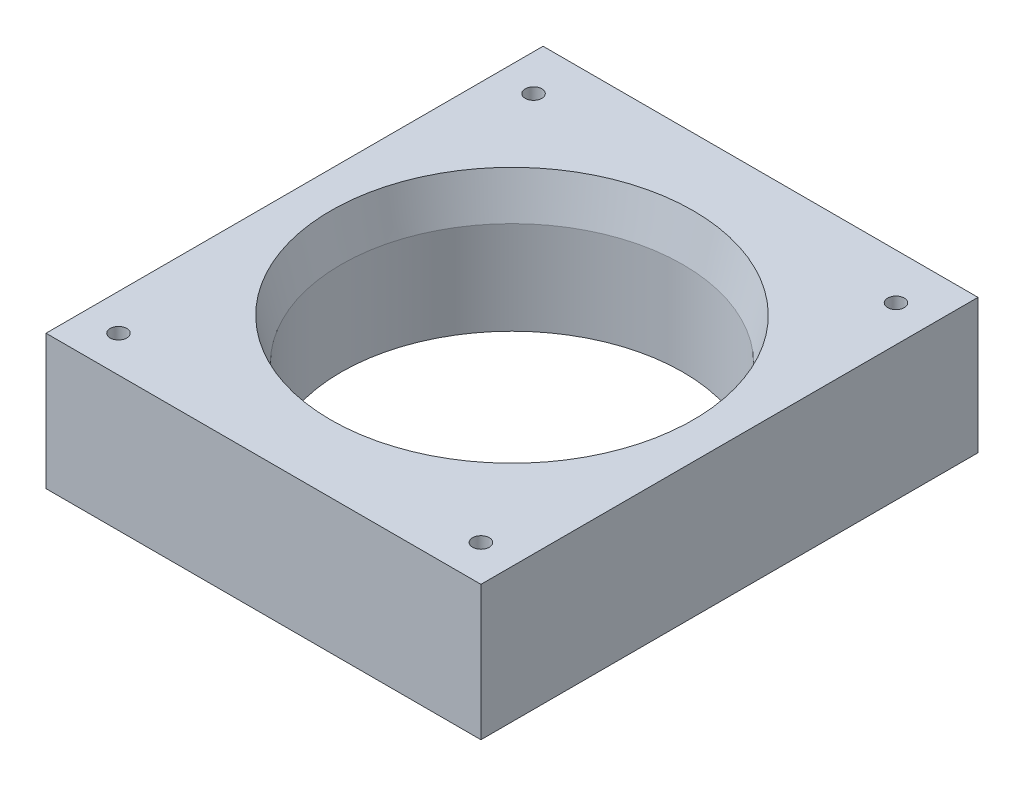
ISO-10303-21;
HEADER;
FILE_DESCRIPTION(('STEP AP214'),'2;1');
FILE_NAME('part.step','',(''),(''),'','','');
FILE_SCHEMA(('AUTOMOTIVE_DESIGN { 1 0 10303 214 1 1 1 1 }'));
ENDSEC;
DATA;
#1=APPLICATION_CONTEXT('core data for automotive mechanical design processes');
#2=APPLICATION_PROTOCOL_DEFINITION('international standard','automotive_design',2000,#1);
#3=PRODUCT_CONTEXT('',#1,'mechanical');
#4=PRODUCT('Part','Part','',(#3));
#5=PRODUCT_RELATED_PRODUCT_CATEGORY('part','',(#4));
#6=PRODUCT_DEFINITION_FORMATION('','',#4);
#7=PRODUCT_DEFINITION_CONTEXT('part definition',#1,'design');
#8=PRODUCT_DEFINITION('design','',#6,#7);
#9=PRODUCT_DEFINITION_SHAPE('','',#8);
#10=(LENGTH_UNIT() NAMED_UNIT(*) SI_UNIT(.MILLI.,.METRE.));
#11=(NAMED_UNIT(*) PLANE_ANGLE_UNIT() SI_UNIT($,.RADIAN.));
#12=(NAMED_UNIT(*) SI_UNIT($,.STERADIAN.) SOLID_ANGLE_UNIT());
#13=UNCERTAINTY_MEASURE_WITH_UNIT(LENGTH_MEASURE(1.E-05),#10,'distance_accuracy_value','');
#14=(GEOMETRIC_REPRESENTATION_CONTEXT(3) GLOBAL_UNCERTAINTY_ASSIGNED_CONTEXT((#13)) GLOBAL_UNIT_ASSIGNED_CONTEXT((#10,
#11,#12)) REPRESENTATION_CONTEXT('',''));
#15=CARTESIAN_POINT('',(0.,0.,0.));
#16=DIRECTION('',(0.,0.,1.));
#17=DIRECTION('',(1.,0.,0.));
#18=AXIS2_PLACEMENT_3D('',#15,#16,#17);
#19=CARTESIAN_POINT('',(-142.875,-3.30200000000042,-266.700021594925));
#20=DIRECTION('',(-1.,0.,0.));
#21=DIRECTION('',(0.,-1.,0.));
#22=AXIS2_PLACEMENT_3D('',#19,#20,#21);
#23=PLANE('',#22);
#24=DIRECTION('',(0.,0.,-1.));
#25=VECTOR('',#24,1.);
#26=CARTESIAN_POINT('',(-142.875,-44.5770000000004,-266.700021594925));
#27=LINE('',#26,#25);
#28=CARTESIAN_POINT('',(-142.875,-44.5770000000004,-266.700021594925));
#29=VERTEX_POINT('',#28);
#30=CARTESIAN_POINT('',(-142.875,-44.5770000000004,-419.100021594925));
#31=VERTEX_POINT('',#30);
#32=EDGE_CURVE('E106',#29,#31,#27,.T.);
#33=ORIENTED_EDGE('',*,*,#32,.F.);
#34=DIRECTION('',(0.,-1.,0.));
#35=VECTOR('',#34,1.);
#36=CARTESIAN_POINT('',(-142.875,-3.30200000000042,-266.700021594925));
#37=LINE('',#36,#35);
#38=CARTESIAN_POINT('',(-142.875,-3.30200000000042,-266.700021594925));
#39=VERTEX_POINT('',#38);
#40=EDGE_CURVE('E54',#39,#29,#37,.T.);
#41=ORIENTED_EDGE('',*,*,#40,.F.);
#42=DIRECTION('',(0.,0.,-1.));
#43=VECTOR('',#42,1.);
#44=CARTESIAN_POINT('',(-142.875,-3.30200000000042,-266.700021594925));
#45=LINE('',#44,#43);
#46=CARTESIAN_POINT('',(-142.875,-3.30200000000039,-419.100021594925));
#47=VERTEX_POINT('',#46);
#48=EDGE_CURVE('E99',#39,#47,#45,.T.);
#49=ORIENTED_EDGE('',*,*,#48,.T.);
#50=DIRECTION('',(0.,-1.,0.));
#51=VECTOR('',#50,1.);
#52=CARTESIAN_POINT('',(-142.875,-3.30200000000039,-419.100021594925));
#53=LINE('',#52,#51);
#54=EDGE_CURVE('E82',#47,#31,#53,.T.);
#55=ORIENTED_EDGE('',*,*,#54,.T.);
#56=EDGE_LOOP('',(#33,#41,#49,#55));
#57=FACE_BOUND('',#56,.T.);
#58=ADVANCED_FACE('F37',(#57),#23,.T.);
#59=CARTESIAN_POINT('',(-9.52500000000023,-3.30200000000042,-266.700021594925));
#60=DIRECTION('',(0.,0.,1.));
#61=DIRECTION('',(0.,-1.,0.));
#62=AXIS2_PLACEMENT_3D('',#59,#60,#61);
#63=PLANE('',#62);
#64=DIRECTION('',(-1.,0.,0.));
#65=VECTOR('',#64,1.);
#66=CARTESIAN_POINT('',(-9.52500000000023,-44.5770000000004,-266.700021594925));
#67=LINE('',#66,#65);
#68=CARTESIAN_POINT('',(-9.52500000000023,-44.5770000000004,-266.700021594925));
#69=VERTEX_POINT('',#68);
#70=EDGE_CURVE('E101',#69,#29,#67,.T.);
#71=ORIENTED_EDGE('',*,*,#70,.F.);
#72=DIRECTION('',(0.,-1.,0.));
#73=VECTOR('',#72,1.);
#74=CARTESIAN_POINT('',(-9.52500000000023,-3.30200000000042,-266.700021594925));
#75=LINE('',#74,#73);
#76=CARTESIAN_POINT('',(-9.52500000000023,-3.30200000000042,-266.700021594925));
#77=VERTEX_POINT('',#76);
#78=EDGE_CURVE('E71',#77,#69,#75,.T.);
#79=ORIENTED_EDGE('',*,*,#78,.F.);
#80=DIRECTION('',(-1.,0.,0.));
#81=VECTOR('',#80,1.);
#82=CARTESIAN_POINT('',(-9.52500000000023,-3.30200000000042,-266.700021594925));
#83=LINE('',#82,#81);
#84=EDGE_CURVE('E96',#77,#39,#83,.T.);
#85=ORIENTED_EDGE('',*,*,#84,.T.);
#86=ORIENTED_EDGE('',*,*,#40,.T.);
#87=EDGE_LOOP('',(#71,#79,#85,#86));
#88=FACE_BOUND('',#87,.T.);
#89=ADVANCED_FACE('F134',(#88),#63,.T.);
#90=CARTESIAN_POINT('',(-9.52500000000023,-3.30200000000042,-266.700021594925));
#91=DIRECTION('',(1.,0.,0.));
#92=DIRECTION('',(0.,1.,0.));
#93=AXIS2_PLACEMENT_3D('',#90,#91,#92);
#94=PLANE('',#93);
#95=DIRECTION('',(0.,0.,1.));
#96=VECTOR('',#95,1.);
#97=CARTESIAN_POINT('',(-9.52500000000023,-44.5770000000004,-266.700021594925));
#98=LINE('',#97,#96);
#99=CARTESIAN_POINT('',(-9.52500000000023,-44.5770000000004,-419.100021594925));
#100=VERTEX_POINT('',#99);
#101=EDGE_CURVE('E90',#100,#69,#98,.T.);
#102=ORIENTED_EDGE('',*,*,#101,.F.);
#103=DIRECTION('',(0.,-1.,0.));
#104=VECTOR('',#103,1.);
#105=CARTESIAN_POINT('',(-9.52500000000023,-3.30200000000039,-419.100021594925));
#106=LINE('',#105,#104);
#107=CARTESIAN_POINT('',(-9.52500000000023,-3.30200000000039,-419.100021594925));
#108=VERTEX_POINT('',#107);
#109=EDGE_CURVE('E85',#108,#100,#106,.T.);
#110=ORIENTED_EDGE('',*,*,#109,.F.);
#111=DIRECTION('',(0.,0.,1.));
#112=VECTOR('',#111,1.);
#113=CARTESIAN_POINT('',(-9.52500000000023,-3.30200000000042,-266.700021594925));
#114=LINE('',#113,#112);
#115=EDGE_CURVE('E88',#108,#77,#114,.T.);
#116=ORIENTED_EDGE('',*,*,#115,.T.);
#117=ORIENTED_EDGE('',*,*,#78,.T.);
#118=EDGE_LOOP('',(#102,#110,#116,#117));
#119=FACE_BOUND('',#118,.T.);
#120=ADVANCED_FACE('F87',(#119),#94,.T.);
#121=CARTESIAN_POINT('',(-9.52500000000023,-3.30200000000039,-419.100021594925));
#122=DIRECTION('',(0.,0.,-1.));
#123=DIRECTION('',(0.,1.,0.));
#124=AXIS2_PLACEMENT_3D('',#121,#122,#123);
#125=PLANE('',#124);
#126=DIRECTION('',(1.,0.,0.));
#127=VECTOR('',#126,1.);
#128=CARTESIAN_POINT('',(-9.52500000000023,-44.5770000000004,-419.100021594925));
#129=LINE('',#128,#127);
#130=EDGE_CURVE('E109',#31,#100,#129,.T.);
#131=ORIENTED_EDGE('',*,*,#130,.F.);
#132=ORIENTED_EDGE('',*,*,#54,.F.);
#133=DIRECTION('',(1.,0.,0.));
#134=VECTOR('',#133,1.);
#135=CARTESIAN_POINT('',(-9.52500000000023,-3.30200000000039,-419.100021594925));
#136=LINE('',#135,#134);
#137=EDGE_CURVE('E95',#47,#108,#136,.T.);
#138=ORIENTED_EDGE('',*,*,#137,.T.);
#139=ORIENTED_EDGE('',*,*,#109,.T.);
#140=EDGE_LOOP('',(#131,#132,#138,#139));
#141=FACE_BOUND('',#140,.T.);
#142=ADVANCED_FACE('F98',(#141),#125,.T.);
#143=CARTESIAN_POINT('',(0.,-3.30200000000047,0.));
#144=DIRECTION('',(0.,1.,0.));
#145=DIRECTION('',(0.,0.,1.));
#146=AXIS2_PLACEMENT_3D('',#143,#144,#145);
#147=PLANE('',#146);
#148=CARTESIAN_POINT('',(-76.2,-3.30200000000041,-342.900021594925));
#149=DIRECTION('',(0.,1.,0.));
#150=DIRECTION('',(0.,0.,1.));
#151=AXIS2_PLACEMENT_3D('',#148,#149,#150);
#152=CIRCLE('',#151,55.5625);
#153=CARTESIAN_POINT('',(-76.2,-3.30200000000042,-287.337521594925));
#154=VERTEX_POINT('',#153);
#155=EDGE_CURVE('E11',#154,#154,#152,.F.);
#156=ORIENTED_EDGE('',*,*,#155,.T.);
#157=EDGE_LOOP('',(#156));
#158=FACE_BOUND('',#157,.T.);
#159=CARTESIAN_POINT('',(-20.6375,-3.30200000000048,-277.812521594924));
#160=DIRECTION('',(0.,-1.,0.));
#161=DIRECTION('',(0.,0.,-1.));
#162=AXIS2_PLACEMENT_3D('',#159,#160,#161);
#163=CIRCLE('',#162,2.55269999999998);
#164=CARTESIAN_POINT('',(-20.6375,-3.30200000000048,-280.365221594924));
#165=VERTEX_POINT('',#164);
#166=EDGE_CURVE('E173',#165,#165,#163,.T.);
#167=ORIENTED_EDGE('',*,*,#166,.T.);
#168=EDGE_LOOP('',(#167));
#169=FACE_BOUND('',#168,.T.);
#170=CARTESIAN_POINT('',(-131.7625,-3.30200000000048,-277.812521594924));
#171=DIRECTION('',(0.,-1.,0.));
#172=DIRECTION('',(0.,0.,-1.));
#173=AXIS2_PLACEMENT_3D('',#170,#171,#172);
#174=CIRCLE('',#173,2.55269999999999);
#175=CARTESIAN_POINT('',(-131.7625,-3.30200000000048,-280.365221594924));
#176=VERTEX_POINT('',#175);
#177=EDGE_CURVE('E168',#176,#176,#174,.T.);
#178=ORIENTED_EDGE('',*,*,#177,.T.);
#179=EDGE_LOOP('',(#178));
#180=FACE_BOUND('',#179,.T.);
#181=CARTESIAN_POINT('',(-131.7625,-3.30200000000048,-405.066521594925));
#182=DIRECTION('',(0.,-1.,0.));
#183=DIRECTION('',(0.,0.,-1.));
#184=AXIS2_PLACEMENT_3D('',#181,#182,#183);
#185=CIRCLE('',#184,2.55269999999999);
#186=CARTESIAN_POINT('',(-131.7625,-3.30200000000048,-407.619221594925));
#187=VERTEX_POINT('',#186);
#188=EDGE_CURVE('E184',#187,#187,#185,.T.);
#189=ORIENTED_EDGE('',*,*,#188,.T.);
#190=EDGE_LOOP('',(#189));
#191=FACE_BOUND('',#190,.T.);
#192=CARTESIAN_POINT('',(-20.6375,-3.30200000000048,-405.066521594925));
#193=DIRECTION('',(0.,-1.,0.));
#194=DIRECTION('',(0.,0.,-1.));
#195=AXIS2_PLACEMENT_3D('',#192,#193,#194);
#196=CIRCLE('',#195,2.55269999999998);
#197=CARTESIAN_POINT('',(-20.6375,-3.30200000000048,-407.619221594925));
#198=VERTEX_POINT('',#197);
#199=EDGE_CURVE('E190',#198,#198,#196,.T.);
#200=ORIENTED_EDGE('',*,*,#199,.T.);
#201=EDGE_LOOP('',(#200));
#202=FACE_BOUND('',#201,.T.);
#203=ORIENTED_EDGE('',*,*,#48,.F.);
#204=ORIENTED_EDGE('',*,*,#84,.F.);
#205=ORIENTED_EDGE('',*,*,#115,.F.);
#206=ORIENTED_EDGE('',*,*,#137,.F.);
#207=EDGE_LOOP('',(#203,#204,#205,#206));
#208=FACE_BOUND('',#207,.T.);
#209=ADVANCED_FACE('F94',(#158,#169,#180,#191,#202,#208),#147,.T.);
#210=CARTESIAN_POINT('',(0.,-44.5770000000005,0.));
#211=DIRECTION('',(0.,1.,0.));
#212=DIRECTION('',(0.,0.,1.));
#213=AXIS2_PLACEMENT_3D('',#210,#211,#212);
#214=PLANE('',#213);
#215=CARTESIAN_POINT('',(-20.6375,-44.5770000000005,-277.812521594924));
#216=DIRECTION('',(0.,-1.,0.));
#217=DIRECTION('',(0.,0.,-1.));
#218=AXIS2_PLACEMENT_3D('',#215,#216,#217);
#219=CIRCLE('',#218,2.55269999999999);
#220=CARTESIAN_POINT('',(-20.6375,-44.5770000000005,-280.365221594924));
#221=VERTEX_POINT('',#220);
#222=EDGE_CURVE('E178',#221,#221,#219,.T.);
#223=ORIENTED_EDGE('',*,*,#222,.F.);
#224=EDGE_LOOP('',(#223));
#225=FACE_BOUND('',#224,.T.);
#226=CARTESIAN_POINT('',(-131.7625,-44.5770000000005,-277.812521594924));
#227=DIRECTION('',(0.,-1.,0.));
#228=DIRECTION('',(0.,0.,-1.));
#229=AXIS2_PLACEMENT_3D('',#226,#227,#228);
#230=CIRCLE('',#229,2.55269999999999);
#231=CARTESIAN_POINT('',(-131.7625,-44.5770000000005,-280.365221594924));
#232=VERTEX_POINT('',#231);
#233=EDGE_CURVE('E171',#232,#232,#230,.T.);
#234=ORIENTED_EDGE('',*,*,#233,.F.);
#235=EDGE_LOOP('',(#234));
#236=FACE_BOUND('',#235,.T.);
#237=CARTESIAN_POINT('',(-131.7625,-44.5770000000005,-405.066521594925));
#238=DIRECTION('',(0.,-1.,0.));
#239=DIRECTION('',(0.,0.,-1.));
#240=AXIS2_PLACEMENT_3D('',#237,#238,#239);
#241=CIRCLE('',#240,2.55269999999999);
#242=CARTESIAN_POINT('',(-131.7625,-44.5770000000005,-407.619221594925));
#243=VERTEX_POINT('',#242);
#244=EDGE_CURVE('E175',#243,#243,#241,.T.);
#245=ORIENTED_EDGE('',*,*,#244,.F.);
#246=EDGE_LOOP('',(#245));
#247=FACE_BOUND('',#246,.T.);
#248=CARTESIAN_POINT('',(-20.6375,-44.5770000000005,-405.066521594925));
#249=DIRECTION('',(0.,-1.,0.));
#250=DIRECTION('',(0.,0.,-1.));
#251=AXIS2_PLACEMENT_3D('',#248,#249,#250);
#252=CIRCLE('',#251,2.55269999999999);
#253=CARTESIAN_POINT('',(-20.6375,-44.5770000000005,-407.619221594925));
#254=VERTEX_POINT('',#253);
#255=EDGE_CURVE('E187',#254,#254,#252,.T.);
#256=ORIENTED_EDGE('',*,*,#255,.F.);
#257=EDGE_LOOP('',(#256));
#258=FACE_BOUND('',#257,.T.);
#259=CARTESIAN_POINT('',(-76.2,-44.5770000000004,-342.900021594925));
#260=DIRECTION('',(0.,1.,0.));
#261=DIRECTION('',(0.,0.,1.));
#262=AXIS2_PLACEMENT_3D('',#259,#260,#261);
#263=CIRCLE('',#262,52.3875);
#264=CARTESIAN_POINT('',(-76.2,-44.5770000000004,-290.512521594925));
#265=VERTEX_POINT('',#264);
#266=EDGE_CURVE('E110',#265,#265,#263,.T.);
#267=ORIENTED_EDGE('',*,*,#266,.T.);
#268=EDGE_LOOP('',(#267));
#269=FACE_BOUND('',#268,.T.);
#270=ORIENTED_EDGE('',*,*,#32,.T.);
#271=ORIENTED_EDGE('',*,*,#130,.T.);
#272=ORIENTED_EDGE('',*,*,#101,.T.);
#273=ORIENTED_EDGE('',*,*,#70,.T.);
#274=EDGE_LOOP('',(#270,#271,#272,#273));
#275=FACE_BOUND('',#274,.T.);
#276=ADVANCED_FACE('F144',(#225,#236,#247,#258,#269,#275),#214,.F.);
#277=CARTESIAN_POINT('',(-76.2,-44.5770000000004,-342.900021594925));
#278=DIRECTION('',(0.,1.,0.));
#279=DIRECTION('',(0.,0.,1.));
#280=AXIS2_PLACEMENT_3D('',#277,#278,#279);
#281=CYLINDRICAL_SURFACE('',#280,52.3875);
#282=CARTESIAN_POINT('',(-76.2,-16.0020000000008,-342.900021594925));
#283=DIRECTION('',(0.,1.,0.));
#284=DIRECTION('',(0.,0.,1.));
#285=AXIS2_PLACEMENT_3D('',#282,#283,#284);
#286=CIRCLE('',#285,52.3875);
#287=CARTESIAN_POINT('',(-76.2,-16.0020000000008,-290.512521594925));
#288=VERTEX_POINT('',#287);
#289=EDGE_CURVE('E46',#288,#288,#286,.T.);
#290=ORIENTED_EDGE('',*,*,#289,.T.);
#291=EDGE_LOOP('',(#290));
#292=FACE_BOUND('',#291,.T.);
#293=ORIENTED_EDGE('',*,*,#266,.F.);
#294=EDGE_LOOP('',(#293));
#295=FACE_BOUND('',#294,.T.);
#296=ADVANCED_FACE('F120',(#292,#295),#281,.F.);
#297=CARTESIAN_POINT('',(-20.6375,-44.5770000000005,-405.066521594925));
#298=DIRECTION('',(0.,-1.,0.));
#299=DIRECTION('',(0.,0.,-1.));
#300=AXIS2_PLACEMENT_3D('',#297,#298,#299);
#301=CYLINDRICAL_SURFACE('',#300,2.55269999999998);
#302=ORIENTED_EDGE('',*,*,#199,.F.);
#303=EDGE_LOOP('',(#302));
#304=FACE_BOUND('',#303,.T.);
#305=ORIENTED_EDGE('',*,*,#255,.T.);
#306=EDGE_LOOP('',(#305));
#307=FACE_BOUND('',#306,.T.);
#308=ADVANCED_FACE('F153',(#304,#307),#301,.F.);
#309=CARTESIAN_POINT('',(-131.7625,-44.5770000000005,-405.066521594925));
#310=DIRECTION('',(0.,-1.,0.));
#311=DIRECTION('',(0.,0.,-1.));
#312=AXIS2_PLACEMENT_3D('',#309,#310,#311);
#313=CYLINDRICAL_SURFACE('',#312,2.55269999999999);
#314=ORIENTED_EDGE('',*,*,#188,.F.);
#315=EDGE_LOOP('',(#314));
#316=FACE_BOUND('',#315,.T.);
#317=ORIENTED_EDGE('',*,*,#244,.T.);
#318=EDGE_LOOP('',(#317));
#319=FACE_BOUND('',#318,.T.);
#320=ADVANCED_FACE('F156',(#316,#319),#313,.F.);
#321=CARTESIAN_POINT('',(-131.7625,-44.5770000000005,-277.812521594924));
#322=DIRECTION('',(0.,-1.,0.));
#323=DIRECTION('',(0.,0.,-1.));
#324=AXIS2_PLACEMENT_3D('',#321,#322,#323);
#325=CYLINDRICAL_SURFACE('',#324,2.55269999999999);
#326=ORIENTED_EDGE('',*,*,#177,.F.);
#327=EDGE_LOOP('',(#326));
#328=FACE_BOUND('',#327,.T.);
#329=ORIENTED_EDGE('',*,*,#233,.T.);
#330=EDGE_LOOP('',(#329));
#331=FACE_BOUND('',#330,.T.);
#332=ADVANCED_FACE('F129',(#328,#331),#325,.F.);
#333=CARTESIAN_POINT('',(-20.6375,-44.5770000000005,-277.812521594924));
#334=DIRECTION('',(0.,-1.,0.));
#335=DIRECTION('',(0.,0.,-1.));
#336=AXIS2_PLACEMENT_3D('',#333,#334,#335);
#337=CYLINDRICAL_SURFACE('',#336,2.55269999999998);
#338=ORIENTED_EDGE('',*,*,#166,.F.);
#339=EDGE_LOOP('',(#338));
#340=FACE_BOUND('',#339,.T.);
#341=ORIENTED_EDGE('',*,*,#222,.T.);
#342=EDGE_LOOP('',(#341));
#343=FACE_BOUND('',#342,.T.);
#344=ADVANCED_FACE('F124',(#340,#343),#337,.F.);
#345=CARTESIAN_POINT('',(-76.2,-16.0020000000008,-342.900021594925));
#346=DIRECTION('',(0.,1.,0.));
#347=DIRECTION('',(0.,0.,1.));
#348=AXIS2_PLACEMENT_3D('',#345,#346,#347);
#349=CONICAL_SURFACE('',#348,52.3875,0.244978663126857);
#350=ORIENTED_EDGE('',*,*,#155,.F.);
#351=EDGE_LOOP('',(#350));
#352=FACE_BOUND('',#351,.T.);
#353=ORIENTED_EDGE('',*,*,#289,.F.);
#354=EDGE_LOOP('',(#353));
#355=FACE_BOUND('',#354,.T.);
#356=ADVANCED_FACE('F39',(#352,#355),#349,.F.);
#357=CLOSED_SHELL('',(#58,#89,#120,#142,#209,#276,#296,#308,#320,#332,#344,#356));
#358=MANIFOLD_SOLID_BREP('B2',#357);
#359=ADVANCED_BREP_SHAPE_REPRESENTATION('',(#18,#358),#14);
#360=SHAPE_DEFINITION_REPRESENTATION(#9,#359);
ENDSEC;
END-ISO-10303-21;
